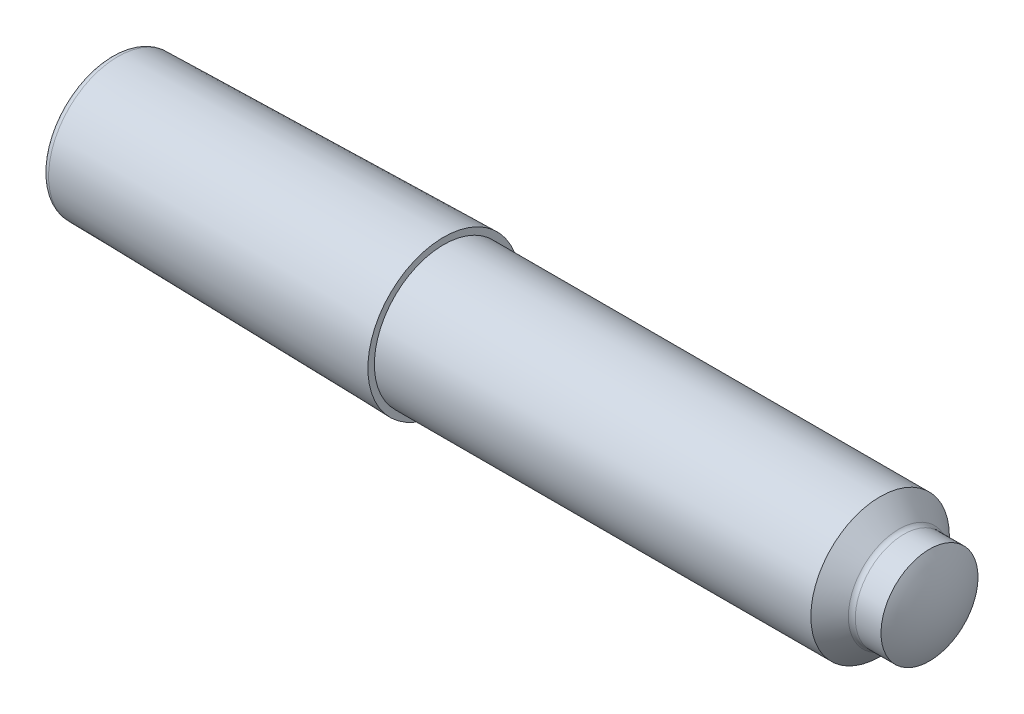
ISO-10303-21;
HEADER;
FILE_DESCRIPTION(('STEP AP214'),'2;1');
FILE_NAME('part.step','',(''),(''),'','','');
FILE_SCHEMA(('AUTOMOTIVE_DESIGN { 1 0 10303 214 1 1 1 1 }'));
ENDSEC;
DATA;
#1=APPLICATION_CONTEXT('core data for automotive mechanical design processes');
#2=APPLICATION_PROTOCOL_DEFINITION('international standard','automotive_design',2000,#1);
#3=PRODUCT_CONTEXT('',#1,'mechanical');
#4=PRODUCT('Part','Part','',(#3));
#5=PRODUCT_RELATED_PRODUCT_CATEGORY('part','',(#4));
#6=PRODUCT_DEFINITION_FORMATION('','',#4);
#7=PRODUCT_DEFINITION_CONTEXT('part definition',#1,'design');
#8=PRODUCT_DEFINITION('design','',#6,#7);
#9=PRODUCT_DEFINITION_SHAPE('','',#8);
#10=(LENGTH_UNIT() NAMED_UNIT(*) SI_UNIT(.MILLI.,.METRE.));
#11=(NAMED_UNIT(*) PLANE_ANGLE_UNIT() SI_UNIT($,.RADIAN.));
#12=(NAMED_UNIT(*) SI_UNIT($,.STERADIAN.) SOLID_ANGLE_UNIT());
#13=UNCERTAINTY_MEASURE_WITH_UNIT(LENGTH_MEASURE(1.E-05),#10,'distance_accuracy_value','');
#14=(GEOMETRIC_REPRESENTATION_CONTEXT(3) GLOBAL_UNCERTAINTY_ASSIGNED_CONTEXT((#13)) GLOBAL_UNIT_ASSIGNED_CONTEXT((#10,
#11,#12)) REPRESENTATION_CONTEXT('',''));
#15=CARTESIAN_POINT('',(0.,0.,0.));
#16=DIRECTION('',(0.,0.,1.));
#17=DIRECTION('',(1.,0.,0.));
#18=AXIS2_PLACEMENT_3D('',#15,#16,#17);
#19=CARTESIAN_POINT('',(26.5,0.,0.));
#20=DIRECTION('',(1.,0.,0.));
#21=DIRECTION('',(0.,-1.,0.));
#22=AXIS2_PLACEMENT_3D('',#19,#20,#21);
#23=SPHERICAL_SURFACE('',#22,3.5);
#24=CARTESIAN_POINT('',(29.5310889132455,0.,0.));
#25=DIRECTION('',(1.,0.,0.));
#26=DIRECTION('',(0.,0.,-1.));
#27=AXIS2_PLACEMENT_3D('',#24,#25,#26);
#28=CIRCLE('',#27,1.75000000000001);
#29=CARTESIAN_POINT('',(29.5310889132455,0.,-1.75000000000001));
#30=VERTEX_POINT('',#29);
#31=EDGE_CURVE('E44',#30,#30,#28,.T.);
#32=ORIENTED_EDGE('',*,*,#31,.T.);
#33=EDGE_LOOP('',(#32));
#34=FACE_BOUND('',#33,.T.);
#35=ADVANCED_FACE('F33',(#34),#23,.T.);
#36=CARTESIAN_POINT('',(0.,0.,0.));
#37=DIRECTION('',(1.,0.,0.));
#38=DIRECTION('',(0.,0.,-1.));
#39=AXIS2_PLACEMENT_3D('',#36,#37,#38);
#40=CYLINDRICAL_SURFACE('',#39,1.75000000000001);
#41=CARTESIAN_POINT('',(28.6035533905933,0.,0.));
#42=DIRECTION('',(1.,0.,0.));
#43=DIRECTION('',(0.,0.,-1.));
#44=AXIS2_PLACEMENT_3D('',#41,#42,#43);
#45=CIRCLE('',#44,1.75000000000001);
#46=CARTESIAN_POINT('',(28.6035533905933,0.,-1.75000000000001));
#47=VERTEX_POINT('',#46);
#48=EDGE_CURVE('E40',#47,#47,#45,.T.);
#49=ORIENTED_EDGE('',*,*,#48,.T.);
#50=EDGE_LOOP('',(#49));
#51=FACE_BOUND('',#50,.T.);
#52=ORIENTED_EDGE('',*,*,#31,.F.);
#53=EDGE_LOOP('',(#52));
#54=FACE_BOUND('',#53,.T.);
#55=ADVANCED_FACE('F80',(#51,#54),#40,.T.);
#56=CARTESIAN_POINT('',(28.5,0.,0.));
#57=DIRECTION('',(-1.,0.,0.));
#58=DIRECTION('',(0.,0.,1.));
#59=AXIS2_PLACEMENT_3D('',#56,#57,#58);
#60=CONICAL_SURFACE('',#59,1.75,0.785398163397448);
#61=CARTESIAN_POINT('',(28.4267766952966,0.,0.));
#62=DIRECTION('',(-1.,0.,0.));
#63=DIRECTION('',(0.,0.,1.));
#64=AXIS2_PLACEMENT_3D('',#61,#62,#63);
#65=CIRCLE('',#64,1.82322330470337);
#66=CARTESIAN_POINT('',(28.4267766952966,0.,1.82322330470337));
#67=VERTEX_POINT('',#66);
#68=EDGE_CURVE('E10',#67,#67,#65,.T.);
#69=ORIENTED_EDGE('',*,*,#68,.T.);
#70=EDGE_LOOP('',(#69));
#71=FACE_BOUND('',#70,.T.);
#72=CARTESIAN_POINT('',(27.75,0.,0.));
#73=DIRECTION('',(1.,0.,0.));
#74=DIRECTION('',(0.,0.,-1.));
#75=AXIS2_PLACEMENT_3D('',#72,#73,#74);
#76=CIRCLE('',#75,2.5);
#77=CARTESIAN_POINT('',(27.75,0.,-2.5));
#78=VERTEX_POINT('',#77);
#79=EDGE_CURVE('E48',#78,#78,#76,.T.);
#80=ORIENTED_EDGE('',*,*,#79,.T.);
#81=EDGE_LOOP('',(#80));
#82=FACE_BOUND('',#81,.T.);
#83=ADVANCED_FACE('F85',(#71,#82),#60,.T.);
#84=CARTESIAN_POINT('',(0.,0.,0.));
#85=DIRECTION('',(1.,0.,0.));
#86=DIRECTION('',(0.,0.,-1.));
#87=AXIS2_PLACEMENT_3D('',#84,#85,#86);
#88=CYLINDRICAL_SURFACE('',#87,2.5);
#89=CARTESIAN_POINT('',(12.,0.,0.));
#90=DIRECTION('',(1.,0.,0.));
#91=DIRECTION('',(0.,0.,-1.));
#92=AXIS2_PLACEMENT_3D('',#89,#90,#91);
#93=CIRCLE('',#92,2.5);
#94=CARTESIAN_POINT('',(12.,0.,-2.5));
#95=VERTEX_POINT('',#94);
#96=EDGE_CURVE('E53',#95,#95,#93,.T.);
#97=ORIENTED_EDGE('',*,*,#96,.T.);
#98=EDGE_LOOP('',(#97));
#99=FACE_BOUND('',#98,.T.);
#100=ORIENTED_EDGE('',*,*,#79,.F.);
#101=EDGE_LOOP('',(#100));
#102=FACE_BOUND('',#101,.T.);
#103=ADVANCED_FACE('F90',(#99,#102),#88,.T.);
#104=CARTESIAN_POINT('',(12.,2.5,0.));
#105=DIRECTION('',(1.,0.,0.));
#106=DIRECTION('',(0.,0.,-1.));
#107=AXIS2_PLACEMENT_3D('',#104,#105,#106);
#108=PLANE('',#107);
#109=CARTESIAN_POINT('',(12.,0.,0.));
#110=DIRECTION('',(1.,0.,0.));
#111=DIRECTION('',(0.,0.,-1.));
#112=AXIS2_PLACEMENT_3D('',#109,#110,#111);
#113=CIRCLE('',#112,2.735099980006);
#114=CARTESIAN_POINT('',(12.,0.,-2.735099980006));
#115=VERTEX_POINT('',#114);
#116=EDGE_CURVE('E56',#115,#115,#113,.T.);
#117=ORIENTED_EDGE('',*,*,#116,.T.);
#118=EDGE_LOOP('',(#117));
#119=FACE_BOUND('',#118,.T.);
#120=ORIENTED_EDGE('',*,*,#96,.F.);
#121=EDGE_LOOP('',(#120));
#122=FACE_BOUND('',#121,.T.);
#123=ADVANCED_FACE('F93',(#119,#122),#108,.T.);
#124=CARTESIAN_POINT('',(12.,0.,0.));
#125=DIRECTION('',(1.,0.,0.));
#126=DIRECTION('',(0.,0.,-1.));
#127=AXIS2_PLACEMENT_3D('',#124,#125,#126);
#128=CONICAL_SURFACE('',#127,2.735099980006,0.0199973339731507);
#129=CARTESIAN_POINT('',(0.2450009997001,0.,0.));
#130=DIRECTION('',(1.,0.,0.));
#131=DIRECTION('',(0.,0.,-1.));
#132=AXIS2_PLACEMENT_3D('',#129,#130,#131);
#133=CIRCLE('',#132,2.5);
#134=CARTESIAN_POINT('',(0.2450009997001,0.,-2.5));
#135=VERTEX_POINT('',#134);
#136=EDGE_CURVE('E59',#135,#135,#133,.T.);
#137=ORIENTED_EDGE('',*,*,#136,.T.);
#138=EDGE_LOOP('',(#137));
#139=FACE_BOUND('',#138,.T.);
#140=ORIENTED_EDGE('',*,*,#116,.F.);
#141=EDGE_LOOP('',(#140));
#142=FACE_BOUND('',#141,.T.);
#143=ADVANCED_FACE('F77',(#139,#142),#128,.T.);
#144=CARTESIAN_POINT('',(0.25,0.,0.));
#145=DIRECTION('',(1.,0.,0.));
#146=DIRECTION('',(0.,0.,-1.));
#147=AXIS2_PLACEMENT_3D('',#144,#145,#146);
#148=TOROIDAL_SURFACE('',#147,2.250049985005,0.25);
#149=CARTESIAN_POINT('',(0.,0.,0.));
#150=DIRECTION('',(1.,0.,0.));
#151=DIRECTION('',(0.,0.,-1.));
#152=AXIS2_PLACEMENT_3D('',#149,#150,#151);
#153=CIRCLE('',#152,2.250049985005);
#154=CARTESIAN_POINT('',(0.,0.,-2.250049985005));
#155=VERTEX_POINT('',#154);
#156=EDGE_CURVE('E62',#155,#155,#153,.T.);
#157=ORIENTED_EDGE('',*,*,#156,.T.);
#158=EDGE_LOOP('',(#157));
#159=FACE_BOUND('',#158,.T.);
#160=ORIENTED_EDGE('',*,*,#136,.F.);
#161=EDGE_LOOP('',(#160));
#162=FACE_BOUND('',#161,.T.);
#163=ADVANCED_FACE('F66',(#159,#162),#148,.T.);
#164=CARTESIAN_POINT('',(0.,0.,0.));
#165=DIRECTION('',(-1.,0.,0.));
#166=DIRECTION('',(0.,0.,1.));
#167=AXIS2_PLACEMENT_3D('',#164,#165,#166);
#168=PLANE('',#167);
#169=ORIENTED_EDGE('',*,*,#156,.F.);
#170=EDGE_LOOP('',(#169));
#171=FACE_BOUND('',#170,.T.);
#172=ADVANCED_FACE('F69',(#171),#168,.T.);
#173=CARTESIAN_POINT('',(28.6035533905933,0.,0.));
#174=DIRECTION('',(1.,0.,0.));
#175=DIRECTION('',(0.,0.,-1.));
#176=AXIS2_PLACEMENT_3D('',#173,#174,#175);
#177=TOROIDAL_SURFACE('',#176,2.00000000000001,0.25);
#178=ORIENTED_EDGE('',*,*,#68,.F.);
#179=EDGE_LOOP('',(#178));
#180=FACE_BOUND('',#179,.T.);
#181=ORIENTED_EDGE('',*,*,#48,.F.);
#182=EDGE_LOOP('',(#181));
#183=FACE_BOUND('',#182,.T.);
#184=ADVANCED_FACE('F35',(#180,#183),#177,.F.);
#185=CLOSED_SHELL('',(#35,#55,#83,#103,#123,#143,#163,#172,#184));
#186=MANIFOLD_SOLID_BREP('B2',#185);
#187=ADVANCED_BREP_SHAPE_REPRESENTATION('',(#18,#186),#14);
#188=SHAPE_DEFINITION_REPRESENTATION(#9,#187);
ENDSEC;
END-ISO-10303-21;
